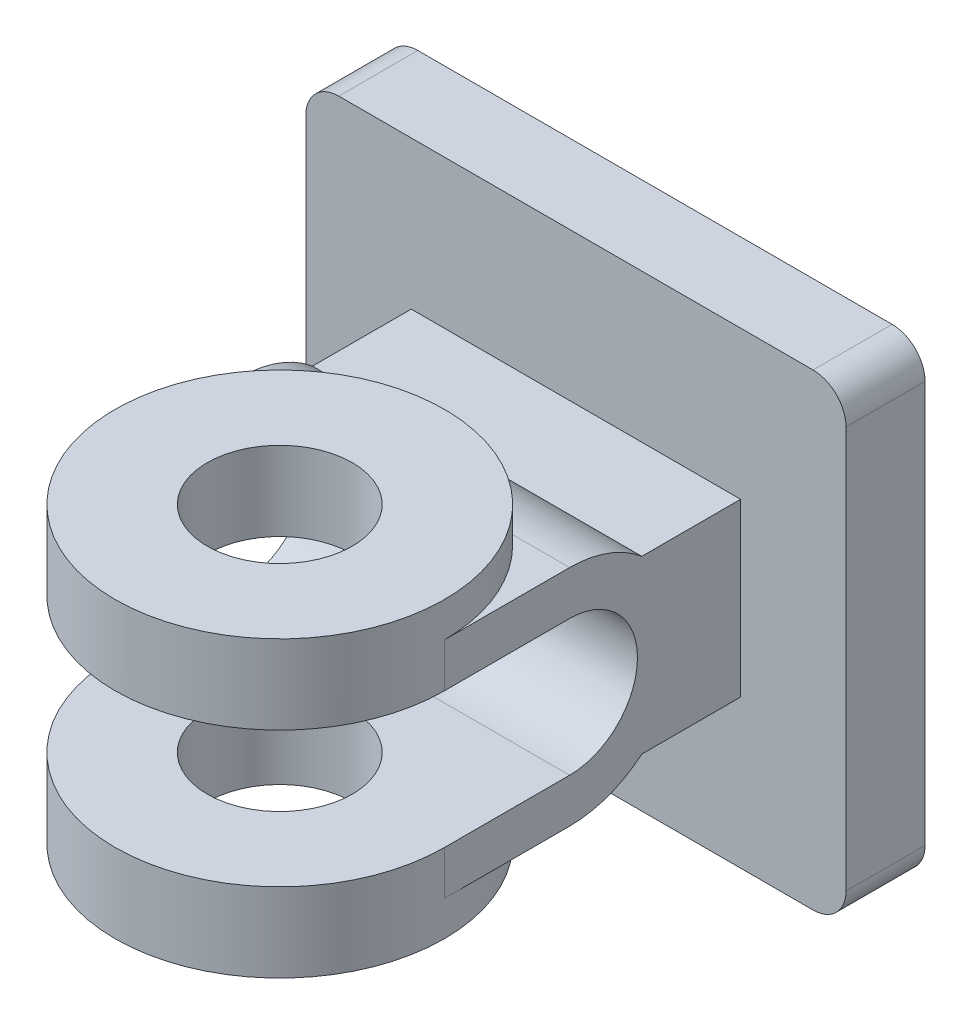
ISO-10303-21;
HEADER;
FILE_DESCRIPTION(('STEP AP214'),'2;1');
FILE_NAME('part.step','',(''),(''),'','','');
FILE_SCHEMA(('AUTOMOTIVE_DESIGN { 1 0 10303 214 1 1 1 1 }'));
ENDSEC;
DATA;
#1=APPLICATION_CONTEXT('core data for automotive mechanical design processes');
#2=APPLICATION_PROTOCOL_DEFINITION('international standard','automotive_design',2000,#1);
#3=PRODUCT_CONTEXT('',#1,'mechanical');
#4=PRODUCT('Part','Part','',(#3));
#5=PRODUCT_RELATED_PRODUCT_CATEGORY('part','',(#4));
#6=PRODUCT_DEFINITION_FORMATION('','',#4);
#7=PRODUCT_DEFINITION_CONTEXT('part definition',#1,'design');
#8=PRODUCT_DEFINITION('design','',#6,#7);
#9=PRODUCT_DEFINITION_SHAPE('','',#8);
#10=(LENGTH_UNIT() NAMED_UNIT(*) SI_UNIT(.MILLI.,.METRE.));
#11=(NAMED_UNIT(*) PLANE_ANGLE_UNIT() SI_UNIT($,.RADIAN.));
#12=(NAMED_UNIT(*) SI_UNIT($,.STERADIAN.) SOLID_ANGLE_UNIT());
#13=UNCERTAINTY_MEASURE_WITH_UNIT(LENGTH_MEASURE(1.E-05),#10,'distance_accuracy_value','');
#14=(GEOMETRIC_REPRESENTATION_CONTEXT(3) GLOBAL_UNCERTAINTY_ASSIGNED_CONTEXT((#13)) GLOBAL_UNIT_ASSIGNED_CONTEXT((#10,
#11,#12)) REPRESENTATION_CONTEXT('',''));
#15=CARTESIAN_POINT('',(0.,0.,0.));
#16=DIRECTION('',(0.,0.,1.));
#17=DIRECTION('',(1.,0.,0.));
#18=AXIS2_PLACEMENT_3D('',#15,#16,#17);
#19=CARTESIAN_POINT('',(10.9375097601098,1.54766260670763E-06,-7.90292921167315));
#20=DIRECTION('',(-1.,0.,0.));
#21=DIRECTION('',(0.,0.,1.));
#22=AXIS2_PLACEMENT_3D('',#19,#20,#21);
#23=CYLINDRICAL_SURFACE('',#22,7.4375);
#24=CARTESIAN_POINT('',(7.10854336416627,7.43750154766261,-7.90292921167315));
#25=CARTESIAN_POINT('',(6.98800695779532,7.43749866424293,-8.00600938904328));
#26=CARTESIAN_POINT('',(6.86525507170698,7.43535896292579,-8.10644028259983));
#27=CARTESIAN_POINT('',(6.61560071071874,7.42744202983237,-8.30179979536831));
#28=CARTESIAN_POINT('',(6.48869912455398,7.42166557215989,-8.39672958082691));
#29=CARTESIAN_POINT('',(6.10239404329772,7.39984918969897,-8.67282425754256));
#30=CARTESIAN_POINT('',(5.83712512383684,7.37931945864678,-8.8455210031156));
#31=CARTESIAN_POINT('',(5.29299524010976,7.33107736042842,-9.16713182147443));
#32=CARTESIAN_POINT('',(5.01412401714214,7.30335950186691,-9.31602757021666));
#33=CARTESIAN_POINT('',(4.44472903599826,7.24519217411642,-9.5890822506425));
#34=CARTESIAN_POINT('',(4.15420328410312,7.2147422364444,-9.71323692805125));
#35=CARTESIAN_POINT('',(3.5828706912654,7.15712576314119,-9.92865872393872));
#36=CARTESIAN_POINT('',(3.30268469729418,7.12987508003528,-10.0215537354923));
#37=CARTESIAN_POINT('',(2.73540133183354,7.07942820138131,-10.1844652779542));
#38=CARTESIAN_POINT('',(2.44830486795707,7.0562314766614,-10.2544847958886));
#39=CARTESIAN_POINT('',(1.86943662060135,7.01632021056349,-10.3710210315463));
#40=CARTESIAN_POINT('',(1.57767369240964,6.99959462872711,-10.4175778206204));
#41=CARTESIAN_POINT('',(0.990974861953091,6.97428428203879,-10.4869490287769));
#42=CARTESIAN_POINT('',(0.696038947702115,6.9656995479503,-10.509763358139));
#43=CARTESIAN_POINT('',(0.101382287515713,6.95750594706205,-10.5315568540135));
#44=CARTESIAN_POINT('',(-0.198351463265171,6.95801310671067,-10.5302279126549));
#45=CARTESIAN_POINT('',(-0.7965442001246,6.96823503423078,-10.5029935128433));
#46=CARTESIAN_POINT('',(-1.09500314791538,6.97795007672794,-10.4770873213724));
#47=CARTESIAN_POINT('',(-1.68892236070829,7.00558487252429,-10.4008970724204));
#48=CARTESIAN_POINT('',(-1.98437651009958,7.02351886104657,-10.350570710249));
#49=CARTESIAN_POINT('',(-2.56971136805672,7.06570357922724,-10.2259819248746));
#50=CARTESIAN_POINT('',(-2.85959218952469,7.08995418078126,-10.1517199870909));
#51=CARTESIAN_POINT('',(-3.4264696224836,7.14169314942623,-9.98148529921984));
#52=CARTESIAN_POINT('',(-3.70360681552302,7.169110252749,-9.88595770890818));
#53=CARTESIAN_POINT('',(-4.24930831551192,7.22464003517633,-9.67298834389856));
#54=CARTESIAN_POINT('',(-4.51787129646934,7.25275282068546,-9.55554319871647));
#55=CARTESIAN_POINT('',(-5.04427021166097,7.30633638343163,-9.29968184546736));
#56=CARTESIAN_POINT('',(-5.3021307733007,7.33181345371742,-9.16131762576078));
#57=CARTESIAN_POINT('',(-5.80622000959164,7.37665347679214,-8.86416162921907));
#58=CARTESIAN_POINT('',(-6.05245565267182,7.39602013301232,-8.7053823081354));
#59=CARTESIAN_POINT('',(-6.43298358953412,7.4189135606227,-8.43775587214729));
#60=CARTESIAN_POINT('',(-6.5716014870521,7.42567899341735,-8.33528677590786));
#61=CARTESIAN_POINT('',(-6.84385970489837,7.43496984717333,-8.12389628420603));
#62=CARTESIAN_POINT('',(-6.97750245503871,7.43749736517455,-8.0149781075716));
#63=CARTESIAN_POINT('',(-7.10852384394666,7.43750154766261,-7.90292921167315));
#64=B_SPLINE_CURVE_WITH_KNOTS('',3,(#24,#25,#26,#27,#28,#29,#30,#31,#32,#33,#34,#35,#36,#37,#38,
#39,#40,#41,#42,#43,#44,#45,#46,#47,#48,#49,#50,#51,#52,#53,#54,#55,#56,#57,#58,#59,#60,#61,#62,
#63),.UNSPECIFIED.,.F.,.F.,(4,2,2,2,2,2,2,2,2,2,2,2,2,2,2,2,2,2,2,4),(0.,0.475687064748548,
0.951272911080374,1.9014028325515,2.85226075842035,3.8032820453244,4.69164351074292,
5.57988892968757,6.46661215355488,7.35333872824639,8.25138925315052,9.1494665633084,
10.0491052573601,10.9487257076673,11.8310391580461,12.7134884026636,13.5937795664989,
14.4735361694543,14.9908520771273,15.5079119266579),.UNSPECIFIED.);
#65=CARTESIAN_POINT('',(7.10854336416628,7.43750154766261,-7.90292921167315));
#66=VERTEX_POINT('',#65);
#67=CARTESIAN_POINT('',(-7.10852384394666,7.43750154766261,-7.90292921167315));
#68=VERTEX_POINT('',#67);
#69=EDGE_CURVE('E311',#66,#68,#64,.T.);
#70=ORIENTED_EDGE('',*,*,#69,.F.);
#71=DIRECTION('',(-1.,0.,0.));
#72=VECTOR('',#71,1.);
#73=CARTESIAN_POINT('',(10.9375097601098,7.43750154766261,-7.90292921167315));
#74=LINE('',#73,#72);
#75=CARTESIAN_POINT('',(10.9375097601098,7.43750154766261,-7.90292921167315));
#76=VERTEX_POINT('',#75);
#77=EDGE_CURVE('E406',#76,#66,#74,.T.);
#78=ORIENTED_EDGE('',*,*,#77,.F.);
#79=CARTESIAN_POINT('',(10.9375097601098,1.54766260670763E-06,-7.90292921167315));
#80=DIRECTION('',(1.,0.,0.));
#81=DIRECTION('',(0.,0.,-1.));
#82=AXIS2_PLACEMENT_3D('',#79,#80,#81);
#83=CIRCLE('',#82,7.4375);
#84=CARTESIAN_POINT('',(10.9375097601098,5.6875015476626,-12.6955015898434));
#85=VERTEX_POINT('',#84);
#86=EDGE_CURVE('E471',#85,#76,#83,.T.);
#87=ORIENTED_EDGE('',*,*,#86,.F.);
#88=DIRECTION('',(-1.,0.,0.));
#89=VECTOR('',#88,1.);
#90=CARTESIAN_POINT('',(10.9375097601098,5.6875015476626,-12.6955015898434));
#91=LINE('',#90,#89);
#92=CARTESIAN_POINT('',(-10.9374902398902,5.6875015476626,-12.6955015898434));
#93=VERTEX_POINT('',#92);
#94=EDGE_CURVE('E227',#85,#93,#91,.T.);
#95=ORIENTED_EDGE('',*,*,#94,.T.);
#96=CARTESIAN_POINT('',(-10.9374902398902,1.54766260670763E-06,-7.90292921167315));
#97=DIRECTION('',(1.,0.,0.));
#98=DIRECTION('',(0.,0.,-1.));
#99=AXIS2_PLACEMENT_3D('',#96,#97,#98);
#100=CIRCLE('',#99,7.4375);
#101=CARTESIAN_POINT('',(-10.9374902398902,7.43750154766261,-7.90292921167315));
#102=VERTEX_POINT('',#101);
#103=EDGE_CURVE('E457',#93,#102,#100,.T.);
#104=ORIENTED_EDGE('',*,*,#103,.T.);
#105=EDGE_CURVE('E409',#68,#102,#74,.T.);
#106=ORIENTED_EDGE('',*,*,#105,.F.);
#107=EDGE_LOOP('',(#70,#78,#87,#95,#104,#106));
#108=FACE_BOUND('',#107,.T.);
#109=ADVANCED_FACE('F46',(#108),#23,.T.);
#110=CARTESIAN_POINT('',(10.9375097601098,7.43750154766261,-7.90292921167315));
#111=DIRECTION('',(0.,-1.,0.));
#112=DIRECTION('',(0.,0.,-1.));
#113=AXIS2_PLACEMENT_3D('',#110,#111,#112);
#114=PLANE('',#113);
#115=CARTESIAN_POINT('',(9.760109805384E-06,7.4375015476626,0.40957078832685));
#116=DIRECTION('',(0.,-1.,0.));
#117=DIRECTION('',(0.,0.,-1.));
#118=AXIS2_PLACEMENT_3D('',#115,#116,#117);
#119=CIRCLE('',#118,10.9375);
#120=CARTESIAN_POINT('',(-10.9374902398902,7.4375015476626,0.409570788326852));
#121=VERTEX_POINT('',#120);
#122=EDGE_CURVE('E306',#68,#121,#119,.F.);
#123=ORIENTED_EDGE('',*,*,#122,.F.);
#124=ORIENTED_EDGE('',*,*,#105,.T.);
#125=DIRECTION('',(0.,0.,1.));
#126=VECTOR('',#125,1.);
#127=CARTESIAN_POINT('',(-10.9374902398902,7.43750154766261,-7.90292921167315));
#128=LINE('',#127,#126);
#129=EDGE_CURVE('E459',#102,#121,#128,.T.);
#130=ORIENTED_EDGE('',*,*,#129,.T.);
#131=EDGE_LOOP('',(#123,#124,#130));
#132=FACE_BOUND('',#131,.T.);
#133=ADVANCED_FACE('F395',(#132),#114,.F.);
#134=CARTESIAN_POINT('',(10.9375097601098,-7.43749845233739,-7.90292921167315));
#135=DIRECTION('',(0.,1.,0.));
#136=DIRECTION('',(0.,0.,1.));
#137=AXIS2_PLACEMENT_3D('',#134,#135,#136);
#138=PLANE('',#137);
#139=DIRECTION('',(0.,0.,-1.));
#140=VECTOR('',#139,1.);
#141=CARTESIAN_POINT('',(10.9375097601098,-7.43749845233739,-7.90292921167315));
#142=LINE('',#141,#140);
#143=CARTESIAN_POINT('',(10.9375097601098,-7.43749845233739,0.409570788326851));
#144=VERTEX_POINT('',#143);
#145=CARTESIAN_POINT('',(10.9375097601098,-7.43749845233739,-7.90292921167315));
#146=VERTEX_POINT('',#145);
#147=EDGE_CURVE('E493',#144,#146,#142,.T.);
#148=ORIENTED_EDGE('',*,*,#147,.F.);
#149=CARTESIAN_POINT('',(9.760109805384E-06,-7.43749845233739,0.40957078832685));
#150=DIRECTION('',(0.,1.,0.));
#151=DIRECTION('',(0.,0.,1.));
#152=AXIS2_PLACEMENT_3D('',#149,#150,#151);
#153=CIRCLE('',#152,10.9375);
#154=CARTESIAN_POINT('',(7.10854336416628,-7.43749845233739,-7.90292921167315));
#155=VERTEX_POINT('',#154);
#156=EDGE_CURVE('E357',#144,#155,#153,.T.);
#157=ORIENTED_EDGE('',*,*,#156,.T.);
#158=DIRECTION('',(-1.,0.,0.));
#159=VECTOR('',#158,1.);
#160=CARTESIAN_POINT('',(10.9375097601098,-7.43749845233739,-7.90292921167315));
#161=LINE('',#160,#159);
#162=EDGE_CURVE('E231',#146,#155,#161,.T.);
#163=ORIENTED_EDGE('',*,*,#162,.F.);
#164=EDGE_LOOP('',(#148,#157,#163));
#165=FACE_BOUND('',#164,.T.);
#166=ADVANCED_FACE('F373',(#165),#138,.F.);
#167=CARTESIAN_POINT('',(10.9375097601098,1.54766260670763E-06,-7.90292921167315));
#168=DIRECTION('',(-1.,0.,0.));
#169=DIRECTION('',(0.,0.,1.));
#170=AXIS2_PLACEMENT_3D('',#167,#168,#169);
#171=CYLINDRICAL_SURFACE('',#170,4.50625);
#172=CARTESIAN_POINT('',(-10.9374902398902,1.54766260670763E-06,-7.90292921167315));
#173=DIRECTION('',(-1.,0.,0.));
#174=DIRECTION('',(0.,0.,-1.));
#175=AXIS2_PLACEMENT_3D('',#172,#173,#174);
#176=CIRCLE('',#175,4.50625);
#177=CARTESIAN_POINT('',(-10.9374902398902,4.50625154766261,-7.90292921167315));
#178=VERTEX_POINT('',#177);
#179=CARTESIAN_POINT('',(-10.9374902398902,-4.50624845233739,-7.90292921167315));
#180=VERTEX_POINT('',#179);
#181=EDGE_CURVE('E430',#178,#180,#176,.T.);
#182=ORIENTED_EDGE('',*,*,#181,.T.);
#183=DIRECTION('',(-1.,0.,0.));
#184=VECTOR('',#183,1.);
#185=CARTESIAN_POINT('',(10.9375097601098,-4.50624845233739,-7.90292921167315));
#186=LINE('',#185,#184);
#187=CARTESIAN_POINT('',(10.9375097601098,-4.50624845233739,-7.90292921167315));
#188=VERTEX_POINT('',#187);
#189=EDGE_CURVE('E234',#188,#180,#186,.T.);
#190=ORIENTED_EDGE('',*,*,#189,.F.);
#191=CARTESIAN_POINT('',(10.9375097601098,1.54766260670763E-06,-7.90292921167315));
#192=DIRECTION('',(-1.,0.,0.));
#193=DIRECTION('',(0.,0.,-1.));
#194=AXIS2_PLACEMENT_3D('',#191,#192,#193);
#195=CIRCLE('',#194,4.50625);
#196=CARTESIAN_POINT('',(10.9375097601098,4.50625154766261,-7.90292921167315));
#197=VERTEX_POINT('',#196);
#198=EDGE_CURVE('E360',#197,#188,#195,.T.);
#199=ORIENTED_EDGE('',*,*,#198,.F.);
#200=DIRECTION('',(-1.,0.,0.));
#201=VECTOR('',#200,1.);
#202=CARTESIAN_POINT('',(10.9375097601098,4.50625154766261,-7.90292921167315));
#203=LINE('',#202,#201);
#204=EDGE_CURVE('E467',#197,#178,#203,.T.);
#205=ORIENTED_EDGE('',*,*,#204,.T.);
#206=EDGE_LOOP('',(#182,#190,#199,#205));
#207=FACE_BOUND('',#206,.T.);
#208=ADVANCED_FACE('F376',(#207),#171,.F.);
#209=CARTESIAN_POINT('',(10.9375097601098,-4.50624845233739,-7.90292921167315));
#210=DIRECTION('',(0.,-1.,0.));
#211=DIRECTION('',(0.,0.,-1.));
#212=AXIS2_PLACEMENT_3D('',#209,#210,#211);
#213=PLANE('',#212);
#214=CARTESIAN_POINT('',(9.760109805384E-06,-4.50624845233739,0.409570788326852));
#215=DIRECTION('',(0.,1.,0.));
#216=DIRECTION('',(0.,0.,1.));
#217=AXIS2_PLACEMENT_3D('',#214,#215,#216);
#218=CIRCLE('',#217,4.8125);
#219=CARTESIAN_POINT('',(9.760109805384E-06,-4.5062484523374,5.22207078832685));
#220=VERTEX_POINT('',#219);
#221=EDGE_CURVE('E241',#220,#220,#218,.T.);
#222=ORIENTED_EDGE('',*,*,#221,.F.);
#223=EDGE_LOOP('',(#222));
#224=FACE_BOUND('',#223,.T.);
#225=DIRECTION('',(0.,0.,1.));
#226=VECTOR('',#225,1.);
#227=CARTESIAN_POINT('',(-10.9374902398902,-4.50624845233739,-7.90292921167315));
#228=LINE('',#227,#226);
#229=CARTESIAN_POINT('',(-10.9374902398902,-4.50624845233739,0.409570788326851));
#230=VERTEX_POINT('',#229);
#231=EDGE_CURVE('E424',#180,#230,#228,.T.);
#232=ORIENTED_EDGE('',*,*,#231,.T.);
#233=CARTESIAN_POINT('',(9.760109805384E-06,-4.50624845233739,0.40957078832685));
#234=DIRECTION('',(0.,1.,0.));
#235=DIRECTION('',(0.,0.,1.));
#236=AXIS2_PLACEMENT_3D('',#233,#234,#235);
#237=CIRCLE('',#236,10.9375);
#238=CARTESIAN_POINT('',(10.9375097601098,-4.50624845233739,0.409570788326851));
#239=VERTEX_POINT('',#238);
#240=EDGE_CURVE('E240',#230,#239,#237,.T.);
#241=ORIENTED_EDGE('',*,*,#240,.T.);
#242=DIRECTION('',(0.,0.,1.));
#243=VECTOR('',#242,1.);
#244=CARTESIAN_POINT('',(10.9375097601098,-4.50624845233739,-7.90292921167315));
#245=LINE('',#244,#243);
#246=EDGE_CURVE('E495',#188,#239,#245,.T.);
#247=ORIENTED_EDGE('',*,*,#246,.F.);
#248=ORIENTED_EDGE('',*,*,#189,.T.);
#249=EDGE_LOOP('',(#232,#241,#247,#248));
#250=FACE_BOUND('',#249,.T.);
#251=ADVANCED_FACE('F371',(#224,#250),#213,.F.);
#252=CARTESIAN_POINT('',(-7.10852384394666,-7.43749845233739,-7.90292921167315));
#253=VERTEX_POINT('',#252);
#254=CARTESIAN_POINT('',(-10.9374902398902,-7.43749845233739,-7.90292921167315));
#255=VERTEX_POINT('',#254);
#256=EDGE_CURVE('E225',#253,#255,#161,.T.);
#257=ORIENTED_EDGE('',*,*,#256,.F.);
#258=CARTESIAN_POINT('',(-10.9374902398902,-7.43749845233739,0.40957078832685));
#259=VERTEX_POINT('',#258);
#260=EDGE_CURVE('E358',#253,#259,#153,.T.);
#261=ORIENTED_EDGE('',*,*,#260,.T.);
#262=DIRECTION('',(0.,0.,-1.));
#263=VECTOR('',#262,1.);
#264=CARTESIAN_POINT('',(-10.9374902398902,-7.43749845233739,-7.90292921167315));
#265=LINE('',#264,#263);
#266=EDGE_CURVE('E434',#259,#255,#265,.T.);
#267=ORIENTED_EDGE('',*,*,#266,.T.);
#268=EDGE_LOOP('',(#257,#261,#267));
#269=FACE_BOUND('',#268,.T.);
#270=ADVANCED_FACE('F367',(#269),#138,.F.);
#271=CARTESIAN_POINT('',(10.9375097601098,1.54766260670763E-06,-7.90292921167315));
#272=DIRECTION('',(-1.,0.,0.));
#273=DIRECTION('',(0.,0.,1.));
#274=AXIS2_PLACEMENT_3D('',#271,#272,#273);
#275=CYLINDRICAL_SURFACE('',#274,7.4375);
#276=ORIENTED_EDGE('',*,*,#162,.T.);
#277=CARTESIAN_POINT('',(7.10854336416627,-7.43749845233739,-7.90292921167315));
#278=CARTESIAN_POINT('',(6.98800695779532,-7.43749556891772,-8.00600938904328));
#279=CARTESIAN_POINT('',(6.86525507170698,-7.43535586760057,-8.10644028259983));
#280=CARTESIAN_POINT('',(6.61560071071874,-7.42743893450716,-8.30179979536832));
#281=CARTESIAN_POINT('',(6.48869912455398,-7.42166247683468,-8.39672958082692));
#282=CARTESIAN_POINT('',(6.10239404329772,-7.39984609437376,-8.67282425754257));
#283=CARTESIAN_POINT('',(5.83712512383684,-7.37931636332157,-8.84552100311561));
#284=CARTESIAN_POINT('',(5.29299524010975,-7.33107426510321,-9.16713182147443));
#285=CARTESIAN_POINT('',(5.01412401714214,-7.30335640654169,-9.31602757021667));
#286=CARTESIAN_POINT('',(4.44472903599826,-7.2451890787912,-9.5890822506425));
#287=CARTESIAN_POINT('',(4.15420328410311,-7.21473914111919,-9.71323692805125));
#288=CARTESIAN_POINT('',(3.5828706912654,-7.15712266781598,-9.92865872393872));
#289=CARTESIAN_POINT('',(3.30268469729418,-7.12987198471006,-10.0215537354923));
#290=CARTESIAN_POINT('',(2.73540133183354,-7.0794251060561,-10.1844652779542));
#291=CARTESIAN_POINT('',(2.44830486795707,-7.05622838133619,-10.2544847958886));
#292=CARTESIAN_POINT('',(1.86943662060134,-7.01631711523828,-10.3710210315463));
#293=CARTESIAN_POINT('',(1.57767369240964,-6.99959153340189,-10.4175778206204));
#294=CARTESIAN_POINT('',(0.990974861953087,-6.97428118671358,-10.4869490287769));
#295=CARTESIAN_POINT('',(0.696038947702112,-6.96569645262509,-10.509763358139));
#296=CARTESIAN_POINT('',(0.101382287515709,-6.95750285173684,-10.5315568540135));
#297=CARTESIAN_POINT('',(-0.198351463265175,-6.95801001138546,-10.5302279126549));
#298=CARTESIAN_POINT('',(-0.796544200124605,-6.96823193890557,-10.5029935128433));
#299=CARTESIAN_POINT('',(-1.09500314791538,-6.97794698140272,-10.4770873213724));
#300=CARTESIAN_POINT('',(-1.68892236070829,-7.00558177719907,-10.4008970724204));
#301=CARTESIAN_POINT('',(-1.98437651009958,-7.02351576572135,-10.350570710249));
#302=CARTESIAN_POINT('',(-2.56971136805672,-7.06570048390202,-10.2259819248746));
#303=CARTESIAN_POINT('',(-2.8595921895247,-7.08995108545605,-10.1517199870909));
#304=CARTESIAN_POINT('',(-3.4264696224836,-7.14169005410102,-9.98148529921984));
#305=CARTESIAN_POINT('',(-3.70360681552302,-7.16910715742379,-9.88595770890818));
#306=CARTESIAN_POINT('',(-4.24930831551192,-7.22463693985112,-9.67298834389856));
#307=CARTESIAN_POINT('',(-4.51787129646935,-7.25274972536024,-9.55554319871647));
#308=CARTESIAN_POINT('',(-5.04427021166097,-7.30633328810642,-9.29968184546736));
#309=CARTESIAN_POINT('',(-5.3021307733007,-7.3318103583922,-9.16131762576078));
#310=CARTESIAN_POINT('',(-5.80622000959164,-7.37665038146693,-8.86416162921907));
#311=CARTESIAN_POINT('',(-6.05245565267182,-7.39601703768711,-8.7053823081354));
#312=CARTESIAN_POINT('',(-6.43298358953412,-7.41891046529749,-8.43775587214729));
#313=CARTESIAN_POINT('',(-6.5716014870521,-7.42567589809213,-8.33528677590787));
#314=CARTESIAN_POINT('',(-6.84385970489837,-7.43496675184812,-8.12389628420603));
#315=CARTESIAN_POINT('',(-6.97750245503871,-7.43749426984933,-8.0149781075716));
#316=CARTESIAN_POINT('',(-7.10852384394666,-7.43749845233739,-7.90292921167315));
#317=B_SPLINE_CURVE_WITH_KNOTS('',3,(#277,#278,#279,#280,#281,#282,#283,#284,#285,#286,#287,
#288,#289,#290,#291,#292,#293,#294,#295,#296,#297,#298,#299,#300,#301,#302,#303,#304,#305,#306,
#307,#308,#309,#310,#311,#312,#313,#314,#315,#316),.UNSPECIFIED.,.F.,.F.,(4,2,2,2,2,2,2,2,2,2,2,
2,2,2,2,2,2,2,2,4),(0.,0.475687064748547,0.951272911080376,1.90140283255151,2.85226075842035,
3.8032820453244,4.69164351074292,5.57988892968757,6.46661215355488,7.35333872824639,
8.25138925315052,9.1494665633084,10.0491052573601,10.9487257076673,11.8310391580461,
12.7134884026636,13.5937795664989,14.4735361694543,14.9908520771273,15.5079119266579),.UNSPECIFIED.);
#318=EDGE_CURVE('E349',#155,#253,#317,.T.);
#319=ORIENTED_EDGE('',*,*,#318,.T.);
#320=ORIENTED_EDGE('',*,*,#256,.T.);
#321=CARTESIAN_POINT('',(-10.9374902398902,1.54766260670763E-06,-7.90292921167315));
#322=DIRECTION('',(1.,0.,0.));
#323=DIRECTION('',(0.,0.,-1.));
#324=AXIS2_PLACEMENT_3D('',#321,#322,#323);
#325=CIRCLE('',#324,7.4375);
#326=CARTESIAN_POINT('',(-10.9374902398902,-5.68749845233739,-12.6955015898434));
#327=VERTEX_POINT('',#326);
#328=EDGE_CURVE('E218',#255,#327,#325,.T.);
#329=ORIENTED_EDGE('',*,*,#328,.T.);
#330=DIRECTION('',(-1.,0.,0.));
#331=VECTOR('',#330,1.);
#332=CARTESIAN_POINT('',(10.9375097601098,-5.68749845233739,-12.6955015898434));
#333=LINE('',#332,#331);
#334=CARTESIAN_POINT('',(10.9375097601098,-5.68749845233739,-12.6955015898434));
#335=VERTEX_POINT('',#334);
#336=EDGE_CURVE('E217',#335,#327,#333,.T.);
#337=ORIENTED_EDGE('',*,*,#336,.F.);
#338=CARTESIAN_POINT('',(10.9375097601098,1.54766260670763E-06,-7.90292921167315));
#339=DIRECTION('',(1.,0.,0.));
#340=DIRECTION('',(0.,0.,-1.));
#341=AXIS2_PLACEMENT_3D('',#338,#339,#340);
#342=CIRCLE('',#341,7.4375);
#343=EDGE_CURVE('E491',#146,#335,#342,.T.);
#344=ORIENTED_EDGE('',*,*,#343,.F.);
#345=EDGE_LOOP('',(#276,#319,#320,#329,#337,#344));
#346=FACE_BOUND('',#345,.T.);
#347=ADVANCED_FACE('F362',(#346),#275,.T.);
#348=CARTESIAN_POINT('',(10.9375097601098,-5.68749845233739,-12.6955015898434));
#349=DIRECTION('',(0.,1.,0.));
#350=DIRECTION('',(0.,0.,1.));
#351=AXIS2_PLACEMENT_3D('',#348,#349,#350);
#352=PLANE('',#351);
#353=DIRECTION('',(0.,0.,-1.));
#354=VECTOR('',#353,1.);
#355=CARTESIAN_POINT('',(-10.9374902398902,-5.68749845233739,-12.6955015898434));
#356=LINE('',#355,#354);
#357=CARTESIAN_POINT('',(-10.9374902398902,-5.68749845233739,-19.2580015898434));
#358=VERTEX_POINT('',#357);
#359=EDGE_CURVE('E202',#327,#358,#356,.T.);
#360=ORIENTED_EDGE('',*,*,#359,.T.);
#361=DIRECTION('',(-1.,0.,0.));
#362=VECTOR('',#361,1.);
#363=CARTESIAN_POINT('',(10.9375097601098,-5.68749845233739,-19.2580015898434));
#364=LINE('',#363,#362);
#365=CARTESIAN_POINT('',(10.9375097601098,-5.68749845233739,-19.2580015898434));
#366=VERTEX_POINT('',#365);
#367=EDGE_CURVE('E214',#366,#358,#364,.T.);
#368=ORIENTED_EDGE('',*,*,#367,.F.);
#369=DIRECTION('',(0.,0.,-1.));
#370=VECTOR('',#369,1.);
#371=CARTESIAN_POINT('',(10.9375097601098,-5.68749845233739,-12.6955015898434));
#372=LINE('',#371,#370);
#373=EDGE_CURVE('E489',#335,#366,#372,.T.);
#374=ORIENTED_EDGE('',*,*,#373,.F.);
#375=ORIENTED_EDGE('',*,*,#336,.T.);
#376=EDGE_LOOP('',(#360,#368,#374,#375));
#377=FACE_BOUND('',#376,.T.);
#378=ADVANCED_FACE('F212',(#377),#352,.F.);
#379=CARTESIAN_POINT('',(10.9375097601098,5.6875015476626,-12.6955015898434));
#380=DIRECTION('',(0.,-1.,0.));
#381=DIRECTION('',(0.,0.,-1.));
#382=AXIS2_PLACEMENT_3D('',#379,#380,#381);
#383=PLANE('',#382);
#384=DIRECTION('',(0.,0.,1.));
#385=VECTOR('',#384,1.);
#386=CARTESIAN_POINT('',(-10.9374902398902,5.6875015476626,-12.6955015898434));
#387=LINE('',#386,#385);
#388=CARTESIAN_POINT('',(-10.9374902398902,5.68750154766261,-19.2580015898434));
#389=VERTEX_POINT('',#388);
#390=EDGE_CURVE('E204',#389,#93,#387,.T.);
#391=ORIENTED_EDGE('',*,*,#390,.T.);
#392=ORIENTED_EDGE('',*,*,#94,.F.);
#393=DIRECTION('',(0.,0.,1.));
#394=VECTOR('',#393,1.);
#395=CARTESIAN_POINT('',(10.9375097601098,5.6875015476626,-12.6955015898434));
#396=LINE('',#395,#394);
#397=CARTESIAN_POINT('',(10.9375097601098,5.68750154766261,-19.2580015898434));
#398=VERTEX_POINT('',#397);
#399=EDGE_CURVE('E486',#398,#85,#396,.T.);
#400=ORIENTED_EDGE('',*,*,#399,.F.);
#401=DIRECTION('',(-1.,0.,0.));
#402=VECTOR('',#401,1.);
#403=CARTESIAN_POINT('',(10.9375097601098,5.68750154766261,-19.2580015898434));
#404=LINE('',#403,#402);
#405=EDGE_CURVE('E223',#398,#389,#404,.T.);
#406=ORIENTED_EDGE('',*,*,#405,.T.);
#407=EDGE_LOOP('',(#391,#392,#400,#406));
#408=FACE_BOUND('',#407,.T.);
#409=ADVANCED_FACE('F506',(#408),#383,.F.);
#410=CARTESIAN_POINT('',(10.9375097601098,7.4375015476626,0.409570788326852));
#411=VERTEX_POINT('',#410);
#412=EDGE_CURVE('E312',#411,#66,#119,.F.);
#413=ORIENTED_EDGE('',*,*,#412,.F.);
#414=DIRECTION('',(0.,0.,1.));
#415=VECTOR('',#414,1.);
#416=CARTESIAN_POINT('',(10.9375097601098,7.43750154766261,-7.90292921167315));
#417=LINE('',#416,#415);
#418=EDGE_CURVE('E414',#76,#411,#417,.T.);
#419=ORIENTED_EDGE('',*,*,#418,.F.);
#420=ORIENTED_EDGE('',*,*,#77,.T.);
#421=EDGE_LOOP('',(#413,#419,#420));
#422=FACE_BOUND('',#421,.T.);
#423=ADVANCED_FACE('F401',(#422),#114,.F.);
#424=CARTESIAN_POINT('',(10.9375097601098,4.50625154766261,-7.90292921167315));
#425=DIRECTION('',(0.,1.,0.));
#426=DIRECTION('',(0.,0.,1.));
#427=AXIS2_PLACEMENT_3D('',#424,#425,#426);
#428=PLANE('',#427);
#429=CARTESIAN_POINT('',(9.760109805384E-06,4.50625154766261,0.409570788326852));
#430=DIRECTION('',(0.,1.,0.));
#431=DIRECTION('',(0.,0.,1.));
#432=AXIS2_PLACEMENT_3D('',#429,#430,#431);
#433=CIRCLE('',#432,4.8125);
#434=CARTESIAN_POINT('',(9.760109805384E-06,4.50625154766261,-4.40292921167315));
#435=VERTEX_POINT('',#434);
#436=EDGE_CURVE('E246',#435,#435,#433,.T.);
#437=ORIENTED_EDGE('',*,*,#436,.T.);
#438=EDGE_LOOP('',(#437));
#439=FACE_BOUND('',#438,.T.);
#440=DIRECTION('',(0.,0.,-1.));
#441=VECTOR('',#440,1.);
#442=CARTESIAN_POINT('',(10.9375097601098,4.50625154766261,-7.90292921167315));
#443=LINE('',#442,#441);
#444=CARTESIAN_POINT('',(10.9375097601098,4.50625154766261,0.409570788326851));
#445=VERTEX_POINT('',#444);
#446=EDGE_CURVE('E451',#445,#197,#443,.T.);
#447=ORIENTED_EDGE('',*,*,#446,.F.);
#448=CARTESIAN_POINT('',(9.760109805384E-06,4.50625154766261,0.40957078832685));
#449=DIRECTION('',(0.,1.,0.));
#450=DIRECTION('',(0.,0.,1.));
#451=AXIS2_PLACEMENT_3D('',#448,#449,#450);
#452=CIRCLE('',#451,10.9375);
#453=CARTESIAN_POINT('',(-10.9374902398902,4.50625154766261,0.40957078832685));
#454=VERTEX_POINT('',#453);
#455=EDGE_CURVE('E245',#454,#445,#452,.T.);
#456=ORIENTED_EDGE('',*,*,#455,.F.);
#457=DIRECTION('',(0.,0.,-1.));
#458=VECTOR('',#457,1.);
#459=CARTESIAN_POINT('',(-10.9374902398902,4.50625154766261,-7.90292921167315));
#460=LINE('',#459,#458);
#461=EDGE_CURVE('E464',#454,#178,#460,.T.);
#462=ORIENTED_EDGE('',*,*,#461,.T.);
#463=ORIENTED_EDGE('',*,*,#204,.F.);
#464=EDGE_LOOP('',(#447,#456,#462,#463));
#465=FACE_BOUND('',#464,.T.);
#466=ADVANCED_FACE('F478',(#439,#465),#428,.F.);
#467=CARTESIAN_POINT('',(10.9375097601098,1.54766260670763E-06,-7.90292921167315));
#468=DIRECTION('',(1.,0.,0.));
#469=DIRECTION('',(0.,0.,-1.));
#470=AXIS2_PLACEMENT_3D('',#467,#468,#469);
#471=PLANE('',#470);
#472=ORIENTED_EDGE('',*,*,#198,.T.);
#473=ORIENTED_EDGE('',*,*,#246,.T.);
#474=DIRECTION('',(0.,-1.,0.));
#475=VECTOR('',#474,1.);
#476=CARTESIAN_POINT('',(10.9375097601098,-4.50624845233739,0.409570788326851));
#477=LINE('',#476,#475);
#478=EDGE_CURVE('E441',#239,#144,#477,.T.);
#479=ORIENTED_EDGE('',*,*,#478,.T.);
#480=ORIENTED_EDGE('',*,*,#147,.T.);
#481=ORIENTED_EDGE('',*,*,#343,.T.);
#482=ORIENTED_EDGE('',*,*,#373,.T.);
#483=DIRECTION('',(0.,1.,0.));
#484=VECTOR('',#483,1.);
#485=CARTESIAN_POINT('',(10.9375097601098,5.68750154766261,-19.2580015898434));
#486=LINE('',#485,#484);
#487=EDGE_CURVE('E222',#366,#398,#486,.T.);
#488=ORIENTED_EDGE('',*,*,#487,.T.);
#489=ORIENTED_EDGE('',*,*,#399,.T.);
#490=ORIENTED_EDGE('',*,*,#86,.T.);
#491=ORIENTED_EDGE('',*,*,#418,.T.);
#492=DIRECTION('',(0.,-1.,0.));
#493=VECTOR('',#492,1.);
#494=CARTESIAN_POINT('',(10.9375097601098,4.50625154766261,0.409570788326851));
#495=LINE('',#494,#493);
#496=EDGE_CURVE('E417',#411,#445,#495,.T.);
#497=ORIENTED_EDGE('',*,*,#496,.T.);
#498=ORIENTED_EDGE('',*,*,#446,.T.);
#499=EDGE_LOOP('',(#472,#473,#479,#480,#481,#482,#488,#489,#490,#491,#497,#498));
#500=FACE_BOUND('',#499,.T.);
#501=ADVANCED_FACE('F346',(#500),#471,.T.);
#502=CARTESIAN_POINT('',(-10.9374902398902,1.54766260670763E-06,-7.90292921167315));
#503=DIRECTION('',(1.,0.,0.));
#504=DIRECTION('',(0.,0.,-1.));
#505=AXIS2_PLACEMENT_3D('',#502,#503,#504);
#506=PLANE('',#505);
#507=ORIENTED_EDGE('',*,*,#181,.F.);
#508=ORIENTED_EDGE('',*,*,#461,.F.);
#509=DIRECTION('',(0.,-1.,0.));
#510=VECTOR('',#509,1.);
#511=CARTESIAN_POINT('',(-10.9374902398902,4.50625154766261,0.409570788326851));
#512=LINE('',#511,#510);
#513=EDGE_CURVE('E461',#121,#454,#512,.T.);
#514=ORIENTED_EDGE('',*,*,#513,.F.);
#515=ORIENTED_EDGE('',*,*,#129,.F.);
#516=ORIENTED_EDGE('',*,*,#103,.F.);
#517=ORIENTED_EDGE('',*,*,#390,.F.);
#518=DIRECTION('',(0.,1.,0.));
#519=VECTOR('',#518,1.);
#520=CARTESIAN_POINT('',(-10.9374902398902,5.68750154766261,-19.2580015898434));
#521=LINE('',#520,#519);
#522=EDGE_CURVE('E197',#358,#389,#521,.T.);
#523=ORIENTED_EDGE('',*,*,#522,.F.);
#524=ORIENTED_EDGE('',*,*,#359,.F.);
#525=ORIENTED_EDGE('',*,*,#328,.F.);
#526=ORIENTED_EDGE('',*,*,#266,.F.);
#527=DIRECTION('',(0.,-1.,0.));
#528=VECTOR('',#527,1.);
#529=CARTESIAN_POINT('',(-10.9374902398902,-4.50624845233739,0.409570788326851));
#530=LINE('',#529,#528);
#531=EDGE_CURVE('E429',#230,#259,#530,.T.);
#532=ORIENTED_EDGE('',*,*,#531,.F.);
#533=ORIENTED_EDGE('',*,*,#231,.F.);
#534=EDGE_LOOP('',(#507,#508,#514,#515,#516,#517,#523,#524,#525,#526,#532,#533));
#535=FACE_BOUND('',#534,.T.);
#536=ADVANCED_FACE('F200',(#535),#506,.F.);
#537=CARTESIAN_POINT('',(9.760109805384E-06,-9.75624845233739,0.40957078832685));
#538=DIRECTION('',(0.,1.,0.));
#539=DIRECTION('',(0.,0.,1.));
#540=AXIS2_PLACEMENT_3D('',#537,#538,#539);
#541=CYLINDRICAL_SURFACE('',#540,10.9375);
#542=CARTESIAN_POINT('',(9.760109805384E-06,-9.75624845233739,0.40957078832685));
#543=DIRECTION('',(0.,1.,0.));
#544=DIRECTION('',(0.,0.,1.));
#545=AXIS2_PLACEMENT_3D('',#542,#543,#544);
#546=CIRCLE('',#545,10.9375);
#547=CARTESIAN_POINT('',(9.760109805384E-06,-9.75624845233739,11.3470707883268));
#548=VERTEX_POINT('',#547);
#549=EDGE_CURVE('E442',#548,#548,#546,.T.);
#550=ORIENTED_EDGE('',*,*,#549,.T.);
#551=EDGE_LOOP('',(#550));
#552=FACE_BOUND('',#551,.T.);
#553=ORIENTED_EDGE('',*,*,#478,.F.);
#554=ORIENTED_EDGE('',*,*,#240,.F.);
#555=ORIENTED_EDGE('',*,*,#531,.T.);
#556=ORIENTED_EDGE('',*,*,#260,.F.);
#557=ORIENTED_EDGE('',*,*,#318,.F.);
#558=ORIENTED_EDGE('',*,*,#156,.F.);
#559=EDGE_LOOP('',(#553,#554,#555,#556,#557,#558));
#560=FACE_BOUND('',#559,.T.);
#561=ADVANCED_FACE('F340',(#552,#560),#541,.T.);
#562=CARTESIAN_POINT('',(9.760109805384E-06,-9.75624845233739,0.40957078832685));
#563=DIRECTION('',(0.,1.,0.));
#564=DIRECTION('',(0.,0.,1.));
#565=AXIS2_PLACEMENT_3D('',#562,#563,#564);
#566=PLANE('',#565);
#567=CARTESIAN_POINT('',(9.760109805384E-06,-9.75624845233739,0.409570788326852));
#568=DIRECTION('',(0.,1.,0.));
#569=DIRECTION('',(0.,0.,1.));
#570=AXIS2_PLACEMENT_3D('',#567,#568,#569);
#571=CIRCLE('',#570,4.8125);
#572=CARTESIAN_POINT('',(9.760109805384E-06,-9.7562484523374,5.22207078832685));
#573=VERTEX_POINT('',#572);
#574=EDGE_CURVE('E237',#573,#573,#571,.T.);
#575=ORIENTED_EDGE('',*,*,#574,.T.);
#576=EDGE_LOOP('',(#575));
#577=FACE_BOUND('',#576,.T.);
#578=ORIENTED_EDGE('',*,*,#549,.F.);
#579=EDGE_LOOP('',(#578));
#580=FACE_BOUND('',#579,.T.);
#581=ADVANCED_FACE('F336',(#577,#580),#566,.F.);
#582=CARTESIAN_POINT('',(9.760109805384E-06,-15.8812484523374,0.409570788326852));
#583=DIRECTION('',(0.,1.,0.));
#584=DIRECTION('',(0.,0.,1.));
#585=AXIS2_PLACEMENT_3D('',#582,#583,#584);
#586=CYLINDRICAL_SURFACE('',#585,4.8125);
#587=CARTESIAN_POINT('',(9.760109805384E-06,-4.5062484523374,5.22207078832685));
#588=CARTESIAN_POINT('',(9.760109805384E-06,-4.5609359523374,5.22207078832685));
#589=CARTESIAN_POINT('',(9.760109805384E-06,-4.6156234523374,5.22207078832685));
#590=CARTESIAN_POINT('',(9.760109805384E-06,-4.7249984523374,5.22207078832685));
#591=CARTESIAN_POINT('',(9.760109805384E-06,-4.7796859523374,5.22207078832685));
#592=CARTESIAN_POINT('',(9.760109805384E-06,-4.8890609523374,5.22207078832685));
#593=CARTESIAN_POINT('',(9.760109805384E-06,-4.9437484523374,5.22207078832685));
#594=CARTESIAN_POINT('',(9.760109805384E-06,-5.0531234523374,5.22207078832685));
#595=CARTESIAN_POINT('',(9.760109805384E-06,-5.1078109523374,5.22207078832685));
#596=CARTESIAN_POINT('',(9.760109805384E-06,-5.2171859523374,5.22207078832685));
#597=CARTESIAN_POINT('',(9.760109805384E-06,-5.2718734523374,5.22207078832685));
#598=CARTESIAN_POINT('',(9.760109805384E-06,-5.3812484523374,5.22207078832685));
#599=CARTESIAN_POINT('',(9.760109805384E-06,-5.4359359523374,5.22207078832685));
#600=CARTESIAN_POINT('',(9.760109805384E-06,-5.5453109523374,5.22207078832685));
#601=CARTESIAN_POINT('',(9.760109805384E-06,-5.5999984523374,5.22207078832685));
#602=CARTESIAN_POINT('',(9.760109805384E-06,-5.7093734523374,5.22207078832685));
#603=CARTESIAN_POINT('',(9.760109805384E-06,-5.7640609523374,5.22207078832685));
#604=CARTESIAN_POINT('',(9.760109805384E-06,-5.8734359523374,5.22207078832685));
#605=CARTESIAN_POINT('',(9.760109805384E-06,-5.9281234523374,5.22207078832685));
#606=CARTESIAN_POINT('',(9.760109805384E-06,-6.0374984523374,5.22207078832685));
#607=CARTESIAN_POINT('',(9.760109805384E-06,-6.0921859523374,5.22207078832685));
#608=CARTESIAN_POINT('',(9.760109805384E-06,-6.2015609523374,5.22207078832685));
#609=CARTESIAN_POINT('',(9.760109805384E-06,-6.25624845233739,5.22207078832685));
#610=CARTESIAN_POINT('',(9.760109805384E-06,-6.3656234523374,5.22207078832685));
#611=CARTESIAN_POINT('',(9.760109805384E-06,-6.4203109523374,5.22207078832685));
#612=CARTESIAN_POINT('',(9.760109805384E-06,-6.5296859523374,5.22207078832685));
#613=CARTESIAN_POINT('',(9.760109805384E-06,-6.5843734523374,5.22207078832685));
#614=CARTESIAN_POINT('',(9.760109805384E-06,-6.6937484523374,5.22207078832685));
#615=CARTESIAN_POINT('',(9.760109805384E-06,-6.7484359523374,5.22207078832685));
#616=CARTESIAN_POINT('',(9.760109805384E-06,-6.8578109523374,5.22207078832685));
#617=CARTESIAN_POINT('',(9.760109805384E-06,-6.9124984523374,5.22207078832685));
#618=CARTESIAN_POINT('',(9.760109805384E-06,-7.0218734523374,5.22207078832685));
#619=CARTESIAN_POINT('',(9.760109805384E-06,-7.07656095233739,5.22207078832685));
#620=CARTESIAN_POINT('',(9.760109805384E-06,-7.18593595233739,5.22207078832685));
#621=CARTESIAN_POINT('',(9.760109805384E-06,-7.2406234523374,5.22207078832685));
#622=CARTESIAN_POINT('',(9.760109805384E-06,-7.3499984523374,5.22207078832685));
#623=CARTESIAN_POINT('',(9.760109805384E-06,-7.4046859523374,5.22207078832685));
#624=CARTESIAN_POINT('',(9.760109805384E-06,-7.5140609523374,5.22207078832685));
#625=CARTESIAN_POINT('',(9.760109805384E-06,-7.5687484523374,5.22207078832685));
#626=CARTESIAN_POINT('',(9.760109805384E-06,-7.6781234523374,5.22207078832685));
#627=CARTESIAN_POINT('',(9.760109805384E-06,-7.7328109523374,5.22207078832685));
#628=CARTESIAN_POINT('',(9.760109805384E-06,-7.84218595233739,5.22207078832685));
#629=CARTESIAN_POINT('',(9.760109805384E-06,-7.8968734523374,5.22207078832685));
#630=CARTESIAN_POINT('',(9.760109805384E-06,-8.0062484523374,5.22207078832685));
#631=CARTESIAN_POINT('',(9.760109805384E-06,-8.0609359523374,5.22207078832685));
#632=CARTESIAN_POINT('',(9.760109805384E-06,-8.1703109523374,5.22207078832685));
#633=CARTESIAN_POINT('',(9.760109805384E-06,-8.2249984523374,5.22207078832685));
#634=CARTESIAN_POINT('',(9.760109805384E-06,-8.33437345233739,5.22207078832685));
#635=CARTESIAN_POINT('',(9.760109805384E-06,-8.3890609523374,5.22207078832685));
#636=CARTESIAN_POINT('',(9.760109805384E-06,-8.49843595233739,5.22207078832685));
#637=CARTESIAN_POINT('',(9.760109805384E-06,-8.55312345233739,5.22207078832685));
#638=CARTESIAN_POINT('',(9.760109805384E-06,-8.66249845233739,5.22207078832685));
#639=CARTESIAN_POINT('',(9.760109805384E-06,-8.71718595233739,5.22207078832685));
#640=CARTESIAN_POINT('',(9.760109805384E-06,-8.8265609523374,5.22207078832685));
#641=CARTESIAN_POINT('',(9.760109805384E-06,-8.8812484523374,5.22207078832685));
#642=CARTESIAN_POINT('',(9.760109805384E-06,-8.9906234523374,5.22207078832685));
#643=CARTESIAN_POINT('',(9.760109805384E-06,-9.0453109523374,5.22207078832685));
#644=CARTESIAN_POINT('',(9.760109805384E-06,-9.15468595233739,5.22207078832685));
#645=CARTESIAN_POINT('',(9.760109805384E-06,-9.2093734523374,5.22207078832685));
#646=CARTESIAN_POINT('',(9.760109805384E-06,-9.31874845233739,5.22207078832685));
#647=CARTESIAN_POINT('',(9.760109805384E-06,-9.37343595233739,5.22207078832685));
#648=CARTESIAN_POINT('',(9.760109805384E-06,-9.48281095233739,5.22207078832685));
#649=CARTESIAN_POINT('',(9.760109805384E-06,-9.53749845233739,5.22207078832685));
#650=CARTESIAN_POINT('',(9.760109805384E-06,-9.6468734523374,5.22207078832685));
#651=CARTESIAN_POINT('',(9.760109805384E-06,-9.70156095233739,5.22207078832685));
#652=CARTESIAN_POINT('',(9.760109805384E-06,-9.7562484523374,5.22207078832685));
#653=B_SPLINE_CURVE_WITH_KNOTS('',3,(#587,#588,#589,#590,#591,#592,#593,#594,#595,#596,#597,
#598,#599,#600,#601,#602,#603,#604,#605,#606,#607,#608,#609,#610,#611,#612,#613,#614,#615,#616,
#617,#618,#619,#620,#621,#622,#623,#624,#625,#626,#627,#628,#629,#630,#631,#632,#633,#634,#635,
#636,#637,#638,#639,#640,#641,#642,#643,#644,#645,#646,#647,#648,#649,#650,#651,#652),
.UNSPECIFIED.,.F.,.F.,(4,2,2,2,2,2,2,2,2,2,2,2,2,2,2,2,2,2,2,2,2,2,2,2,2,2,2,2,2,2,2,2,4),(0.,
0.164062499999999,0.328125,0.4921875,0.656250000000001,0.8203125,0.984374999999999,1.1484375,
1.3125,1.4765625,1.640625,1.8046875,1.96875,2.1328125,2.296875,2.4609375,2.625,2.7890625,
2.953125,3.1171875,3.28125,3.4453125,3.609375,3.7734375,3.9375,4.1015625,4.265625,4.4296875,
4.59375,4.7578125,4.921875,5.0859375,5.25),.UNSPECIFIED.);
#654=EDGE_CURVE('BSEAM331',#220,#573,#653,.T.);
#655=ORIENTED_EDGE('',*,*,#221,.T.);
#656=ORIENTED_EDGE('',*,*,#574,.F.);
#657=ORIENTED_EDGE('',*,*,#654,.T.);
#658=ORIENTED_EDGE('',*,*,#654,.F.);
#659=EDGE_LOOP('',(#655,#657,#656,#658));
#660=FACE_BOUND('',#659,.T.);
#661=ADVANCED_FACE('F331',(#660),#586,.F.);
#662=CARTESIAN_POINT('',(9.760109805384E-06,9.75625154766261,0.40957078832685));
#663=DIRECTION('',(0.,-1.,0.));
#664=DIRECTION('',(0.,0.,-1.));
#665=AXIS2_PLACEMENT_3D('',#662,#663,#664);
#666=CYLINDRICAL_SURFACE('',#665,10.9375);
#667=CARTESIAN_POINT('',(9.760109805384E-06,9.75625154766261,0.40957078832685));
#668=DIRECTION('',(0.,1.,0.));
#669=DIRECTION('',(0.,0.,1.));
#670=AXIS2_PLACEMENT_3D('',#667,#668,#669);
#671=CIRCLE('',#670,10.9375);
#672=CARTESIAN_POINT('',(9.760109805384E-06,9.75625154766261,11.3470707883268));
#673=VERTEX_POINT('',#672);
#674=EDGE_CURVE('E303',#673,#673,#671,.T.);
#675=ORIENTED_EDGE('',*,*,#674,.F.);
#676=EDGE_LOOP('',(#675));
#677=FACE_BOUND('',#676,.T.);
#678=ORIENTED_EDGE('',*,*,#455,.T.);
#679=ORIENTED_EDGE('',*,*,#496,.F.);
#680=ORIENTED_EDGE('',*,*,#412,.T.);
#681=ORIENTED_EDGE('',*,*,#69,.T.);
#682=ORIENTED_EDGE('',*,*,#122,.T.);
#683=ORIENTED_EDGE('',*,*,#513,.T.);
#684=EDGE_LOOP('',(#678,#679,#680,#681,#682,#683));
#685=FACE_BOUND('',#684,.T.);
#686=ADVANCED_FACE('F325',(#677,#685),#666,.T.);
#687=CARTESIAN_POINT('',(9.760109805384E-06,9.75625154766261,0.40957078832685));
#688=DIRECTION('',(0.,-1.,0.));
#689=DIRECTION('',(0.,0.,1.));
#690=AXIS2_PLACEMENT_3D('',#687,#688,#689);
#691=PLANE('',#690);
#692=CARTESIAN_POINT('',(9.760109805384E-06,9.75625154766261,0.409570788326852));
#693=DIRECTION('',(0.,-1.,0.));
#694=DIRECTION('',(0.,0.,-1.));
#695=AXIS2_PLACEMENT_3D('',#692,#693,#694);
#696=CIRCLE('',#695,4.8125);
#697=CARTESIAN_POINT('',(9.760109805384E-06,9.75625154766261,-4.40292921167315));
#698=VERTEX_POINT('',#697);
#699=EDGE_CURVE('E242',#698,#698,#696,.F.);
#700=ORIENTED_EDGE('',*,*,#699,.F.);
#701=EDGE_LOOP('',(#700));
#702=FACE_BOUND('',#701,.T.);
#703=ORIENTED_EDGE('',*,*,#674,.T.);
#704=EDGE_LOOP('',(#703));
#705=FACE_BOUND('',#704,.T.);
#706=ADVANCED_FACE('F330',(#702,#705),#691,.F.);
#707=CARTESIAN_POINT('',(9.760109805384E-06,15.8812515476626,0.409570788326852));
#708=DIRECTION('',(0.,-1.,0.));
#709=DIRECTION('',(0.,0.,-1.));
#710=AXIS2_PLACEMENT_3D('',#707,#708,#709);
#711=CYLINDRICAL_SURFACE('',#710,4.8125);
#712=CARTESIAN_POINT('',(9.760109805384E-06,4.50625154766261,-4.40292921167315));
#713=CARTESIAN_POINT('',(9.760109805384E-06,4.56093904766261,-4.40292921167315));
#714=CARTESIAN_POINT('',(9.760109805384E-06,4.61562654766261,-4.40292921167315));
#715=CARTESIAN_POINT('',(9.760109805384E-06,4.72500154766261,-4.40292921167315));
#716=CARTESIAN_POINT('',(9.760109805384E-06,4.77968904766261,-4.40292921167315));
#717=CARTESIAN_POINT('',(9.760109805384E-06,4.88906404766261,-4.40292921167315));
#718=CARTESIAN_POINT('',(9.760109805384E-06,4.94375154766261,-4.40292921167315));
#719=CARTESIAN_POINT('',(9.760109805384E-06,5.05312654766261,-4.40292921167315));
#720=CARTESIAN_POINT('',(9.760109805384E-06,5.10781404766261,-4.40292921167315));
#721=CARTESIAN_POINT('',(9.760109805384E-06,5.21718904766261,-4.40292921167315));
#722=CARTESIAN_POINT('',(9.760109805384E-06,5.27187654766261,-4.40292921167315));
#723=CARTESIAN_POINT('',(9.760109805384E-06,5.38125154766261,-4.40292921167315));
#724=CARTESIAN_POINT('',(9.760109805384E-06,5.43593904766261,-4.40292921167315));
#725=CARTESIAN_POINT('',(9.760109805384E-06,5.54531404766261,-4.40292921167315));
#726=CARTESIAN_POINT('',(9.760109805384E-06,5.60000154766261,-4.40292921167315));
#727=CARTESIAN_POINT('',(9.760109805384E-06,5.70937654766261,-4.40292921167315));
#728=CARTESIAN_POINT('',(9.760109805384E-06,5.76406404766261,-4.40292921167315));
#729=CARTESIAN_POINT('',(9.760109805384E-06,5.87343904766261,-4.40292921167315));
#730=CARTESIAN_POINT('',(9.760109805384E-06,5.92812654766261,-4.40292921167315));
#731=CARTESIAN_POINT('',(9.760109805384E-06,6.03750154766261,-4.40292921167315));
#732=CARTESIAN_POINT('',(9.760109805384E-06,6.09218904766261,-4.40292921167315));
#733=CARTESIAN_POINT('',(9.760109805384E-06,6.20156404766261,-4.40292921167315));
#734=CARTESIAN_POINT('',(9.760109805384E-06,6.25625154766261,-4.40292921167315));
#735=CARTESIAN_POINT('',(9.760109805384E-06,6.36562654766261,-4.40292921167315));
#736=CARTESIAN_POINT('',(9.760109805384E-06,6.42031404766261,-4.40292921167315));
#737=CARTESIAN_POINT('',(9.760109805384E-06,6.52968904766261,-4.40292921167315));
#738=CARTESIAN_POINT('',(9.760109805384E-06,6.58437654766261,-4.40292921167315));
#739=CARTESIAN_POINT('',(9.760109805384E-06,6.69375154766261,-4.40292921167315));
#740=CARTESIAN_POINT('',(9.760109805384E-06,6.74843904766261,-4.40292921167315));
#741=CARTESIAN_POINT('',(9.760109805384E-06,6.85781404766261,-4.40292921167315));
#742=CARTESIAN_POINT('',(9.760109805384E-06,6.91250154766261,-4.40292921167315));
#743=CARTESIAN_POINT('',(9.760109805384E-06,7.02187654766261,-4.40292921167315));
#744=CARTESIAN_POINT('',(9.760109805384E-06,7.07656404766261,-4.40292921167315));
#745=CARTESIAN_POINT('',(9.760109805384E-06,7.18593904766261,-4.40292921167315));
#746=CARTESIAN_POINT('',(9.760109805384E-06,7.24062654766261,-4.40292921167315));
#747=CARTESIAN_POINT('',(9.760109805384E-06,7.35000154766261,-4.40292921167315));
#748=CARTESIAN_POINT('',(9.760109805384E-06,7.40468904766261,-4.40292921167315));
#749=CARTESIAN_POINT('',(9.760109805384E-06,7.51406404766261,-4.40292921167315));
#750=CARTESIAN_POINT('',(9.760109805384E-06,7.56875154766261,-4.40292921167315));
#751=CARTESIAN_POINT('',(9.760109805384E-06,7.67812654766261,-4.40292921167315));
#752=CARTESIAN_POINT('',(9.760109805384E-06,7.73281404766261,-4.40292921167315));
#753=CARTESIAN_POINT('',(9.760109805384E-06,7.84218904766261,-4.40292921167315));
#754=CARTESIAN_POINT('',(9.760109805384E-06,7.89687654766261,-4.40292921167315));
#755=CARTESIAN_POINT('',(9.760109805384E-06,8.00625154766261,-4.40292921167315));
#756=CARTESIAN_POINT('',(9.760109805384E-06,8.06093904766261,-4.40292921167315));
#757=CARTESIAN_POINT('',(9.760109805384E-06,8.17031404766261,-4.40292921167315));
#758=CARTESIAN_POINT('',(9.760109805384E-06,8.22500154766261,-4.40292921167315));
#759=CARTESIAN_POINT('',(9.760109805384E-06,8.33437654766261,-4.40292921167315));
#760=CARTESIAN_POINT('',(9.760109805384E-06,8.38906404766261,-4.40292921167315));
#761=CARTESIAN_POINT('',(9.760109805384E-06,8.4984390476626,-4.40292921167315));
#762=CARTESIAN_POINT('',(9.760109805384E-06,8.55312654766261,-4.40292921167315));
#763=CARTESIAN_POINT('',(9.760109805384E-06,8.66250154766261,-4.40292921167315));
#764=CARTESIAN_POINT('',(9.760109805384E-06,8.71718904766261,-4.40292921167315));
#765=CARTESIAN_POINT('',(9.760109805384E-06,8.82656404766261,-4.40292921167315));
#766=CARTESIAN_POINT('',(9.760109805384E-06,8.88125154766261,-4.40292921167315));
#767=CARTESIAN_POINT('',(9.760109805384E-06,8.99062654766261,-4.40292921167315));
#768=CARTESIAN_POINT('',(9.760109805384E-06,9.04531404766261,-4.40292921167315));
#769=CARTESIAN_POINT('',(9.760109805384E-06,9.15468904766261,-4.40292921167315));
#770=CARTESIAN_POINT('',(9.760109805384E-06,9.20937654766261,-4.40292921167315));
#771=CARTESIAN_POINT('',(9.760109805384E-06,9.3187515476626,-4.40292921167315));
#772=CARTESIAN_POINT('',(9.760109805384E-06,9.37343904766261,-4.40292921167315));
#773=CARTESIAN_POINT('',(9.760109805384E-06,9.48281404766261,-4.40292921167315));
#774=CARTESIAN_POINT('',(9.760109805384E-06,9.5375015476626,-4.40292921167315));
#775=CARTESIAN_POINT('',(9.760109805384E-06,9.64687654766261,-4.40292921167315));
#776=CARTESIAN_POINT('',(9.760109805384E-06,9.70156404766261,-4.40292921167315));
#777=CARTESIAN_POINT('',(9.760109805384E-06,9.75625154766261,-4.40292921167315));
#778=B_SPLINE_CURVE_WITH_KNOTS('',3,(#712,#713,#714,#715,#716,#717,#718,#719,#720,#721,#722,
#723,#724,#725,#726,#727,#728,#729,#730,#731,#732,#733,#734,#735,#736,#737,#738,#739,#740,#741,
#742,#743,#744,#745,#746,#747,#748,#749,#750,#751,#752,#753,#754,#755,#756,#757,#758,#759,#760,
#761,#762,#763,#764,#765,#766,#767,#768,#769,#770,#771,#772,#773,#774,#775,#776,#777),
.UNSPECIFIED.,.F.,.F.,(4,2,2,2,2,2,2,2,2,2,2,2,2,2,2,2,2,2,2,2,2,2,2,2,2,2,2,2,2,2,2,2,4),(0.,
0.164062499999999,0.328125,0.4921875,0.656250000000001,0.8203125,0.984374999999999,1.1484375,
1.3125,1.4765625,1.640625,1.8046875,1.96875,2.1328125,2.296875,2.4609375,2.625,2.7890625,
2.953125,3.1171875,3.28125,3.4453125,3.609375,3.7734375,3.9375,4.1015625,4.265625,4.4296875,
4.59375,4.7578125,4.921875,5.0859375,5.25),.UNSPECIFIED.);
#779=EDGE_CURVE('BSEAM509',#435,#698,#778,.T.);
#780=ORIENTED_EDGE('',*,*,#436,.F.);
#781=ORIENTED_EDGE('',*,*,#699,.T.);
#782=ORIENTED_EDGE('',*,*,#779,.T.);
#783=ORIENTED_EDGE('',*,*,#779,.F.);
#784=EDGE_LOOP('',(#780,#782,#781,#783));
#785=FACE_BOUND('',#784,.T.);
#786=ADVANCED_FACE('F509',(#785),#711,.F.);
#787=CARTESIAN_POINT('',(-17.9374902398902,-15.5312484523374,-24.5080015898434));
#788=DIRECTION('',(1.,0.,0.));
#789=DIRECTION('',(0.,0.,-1.));
#790=AXIS2_PLACEMENT_3D('',#787,#788,#789);
#791=PLANE('',#790);
#792=DIRECTION('',(0.,1.,0.));
#793=VECTOR('',#792,1.);
#794=CARTESIAN_POINT('',(-17.9374902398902,-15.5312484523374,-24.5080015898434));
#795=LINE('',#794,#793);
#796=CARTESIAN_POINT('',(-17.9374902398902,-13.3437484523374,-24.5080015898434));
#797=VERTEX_POINT('',#796);
#798=CARTESIAN_POINT('',(-17.9374902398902,13.3437515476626,-24.5080015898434));
#799=VERTEX_POINT('',#798);
#800=EDGE_CURVE('E299',#797,#799,#795,.T.);
#801=ORIENTED_EDGE('',*,*,#800,.F.);
#802=DIRECTION('',(0.,0.,1.));
#803=VECTOR('',#802,1.);
#804=CARTESIAN_POINT('',(-17.9374902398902,-13.3437484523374,-24.5080015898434));
#805=LINE('',#804,#803);
#806=CARTESIAN_POINT('',(-17.9374902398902,-13.3437484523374,-19.2580015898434));
#807=VERTEX_POINT('',#806);
#808=EDGE_CURVE('E248',#797,#807,#805,.T.);
#809=ORIENTED_EDGE('',*,*,#808,.T.);
#810=DIRECTION('',(0.,1.,0.));
#811=VECTOR('',#810,1.);
#812=CARTESIAN_POINT('',(-17.9374902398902,-15.5312484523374,-19.2580015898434));
#813=LINE('',#812,#811);
#814=CARTESIAN_POINT('',(-17.9374902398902,13.3437515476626,-19.2580015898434));
#815=VERTEX_POINT('',#814);
#816=EDGE_CURVE('E290',#807,#815,#813,.T.);
#817=ORIENTED_EDGE('',*,*,#816,.T.);
#818=DIRECTION('',(0.,0.,1.));
#819=VECTOR('',#818,1.);
#820=CARTESIAN_POINT('',(-17.9374902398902,13.3437515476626,-24.5080015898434));
#821=LINE('',#820,#819);
#822=EDGE_CURVE('E236',#815,#799,#821,.F.);
#823=ORIENTED_EDGE('',*,*,#822,.T.);
#824=EDGE_LOOP('',(#801,#809,#817,#823));
#825=FACE_BOUND('',#824,.T.);
#826=ADVANCED_FACE('F512',(#825),#791,.F.);
#827=CARTESIAN_POINT('',(17.9375097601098,15.5312515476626,-24.5080015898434));
#828=DIRECTION('',(0.,-1.,0.));
#829=DIRECTION('',(0.,0.,-1.));
#830=AXIS2_PLACEMENT_3D('',#827,#828,#829);
#831=PLANE('',#830);
#832=DIRECTION('',(1.,0.,0.));
#833=VECTOR('',#832,1.);
#834=CARTESIAN_POINT('',(17.9375097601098,15.5312515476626,-19.2580015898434));
#835=LINE('',#834,#833);
#836=CARTESIAN_POINT('',(-15.7499902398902,15.5312515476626,-19.2580015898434));
#837=VERTEX_POINT('',#836);
#838=CARTESIAN_POINT('',(15.7500097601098,15.5312515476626,-19.2580015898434));
#839=VERTEX_POINT('',#838);
#840=EDGE_CURVE('E281',#837,#839,#835,.T.);
#841=ORIENTED_EDGE('',*,*,#840,.T.);
#842=DIRECTION('',(0.,0.,1.));
#843=VECTOR('',#842,1.);
#844=CARTESIAN_POINT('',(15.7500097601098,15.5312515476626,-24.5080015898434));
#845=LINE('',#844,#843);
#846=CARTESIAN_POINT('',(15.7500097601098,15.5312515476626,-24.5080015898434));
#847=VERTEX_POINT('',#846);
#848=EDGE_CURVE('E12',#839,#847,#845,.F.);
#849=ORIENTED_EDGE('',*,*,#848,.T.);
#850=DIRECTION('',(1.,0.,0.));
#851=VECTOR('',#850,1.);
#852=CARTESIAN_POINT('',(17.9375097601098,15.5312515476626,-24.5080015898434));
#853=LINE('',#852,#851);
#854=CARTESIAN_POINT('',(-15.7499902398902,15.5312515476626,-24.5080015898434));
#855=VERTEX_POINT('',#854);
#856=EDGE_CURVE('E283',#855,#847,#853,.T.);
#857=ORIENTED_EDGE('',*,*,#856,.F.);
#858=DIRECTION('',(0.,0.,1.));
#859=VECTOR('',#858,1.);
#860=CARTESIAN_POINT('',(-15.7499902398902,15.5312515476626,-24.5080015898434));
#861=LINE('',#860,#859);
#862=EDGE_CURVE('E54',#855,#837,#861,.T.);
#863=ORIENTED_EDGE('',*,*,#862,.T.);
#864=EDGE_LOOP('',(#841,#849,#857,#863));
#865=FACE_BOUND('',#864,.T.);
#866=ADVANCED_FACE('F280',(#865),#831,.F.);
#867=CARTESIAN_POINT('',(17.9375097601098,-15.5312484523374,-24.5080015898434));
#868=DIRECTION('',(-1.,0.,0.));
#869=DIRECTION('',(0.,0.,1.));
#870=AXIS2_PLACEMENT_3D('',#867,#868,#869);
#871=PLANE('',#870);
#872=DIRECTION('',(0.,-1.,0.));
#873=VECTOR('',#872,1.);
#874=CARTESIAN_POINT('',(17.9375097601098,-15.5312484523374,-19.2580015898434));
#875=LINE('',#874,#873);
#876=CARTESIAN_POINT('',(17.9375097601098,13.3437515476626,-19.2580015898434));
#877=VERTEX_POINT('',#876);
#878=CARTESIAN_POINT('',(17.9375097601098,-13.3437484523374,-19.2580015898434));
#879=VERTEX_POINT('',#878);
#880=EDGE_CURVE('E289',#877,#879,#875,.T.);
#881=ORIENTED_EDGE('',*,*,#880,.T.);
#882=DIRECTION('',(0.,0.,1.));
#883=VECTOR('',#882,1.);
#884=CARTESIAN_POINT('',(17.9375097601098,-13.3437484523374,-24.5080015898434));
#885=LINE('',#884,#883);
#886=CARTESIAN_POINT('',(17.9375097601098,-13.3437484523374,-24.5080015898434));
#887=VERTEX_POINT('',#886);
#888=EDGE_CURVE('E61',#879,#887,#885,.F.);
#889=ORIENTED_EDGE('',*,*,#888,.T.);
#890=DIRECTION('',(0.,-1.,0.));
#891=VECTOR('',#890,1.);
#892=CARTESIAN_POINT('',(17.9375097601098,-15.5312484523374,-24.5080015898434));
#893=LINE('',#892,#891);
#894=CARTESIAN_POINT('',(17.9375097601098,13.3437515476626,-24.5080015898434));
#895=VERTEX_POINT('',#894);
#896=EDGE_CURVE('E719',#895,#887,#893,.T.);
#897=ORIENTED_EDGE('',*,*,#896,.F.);
#898=DIRECTION('',(0.,0.,1.));
#899=VECTOR('',#898,1.);
#900=CARTESIAN_POINT('',(17.9375097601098,13.3437515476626,-24.5080015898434));
#901=LINE('',#900,#899);
#902=EDGE_CURVE('E271',#895,#877,#901,.T.);
#903=ORIENTED_EDGE('',*,*,#902,.T.);
#904=EDGE_LOOP('',(#881,#889,#897,#903));
#905=FACE_BOUND('',#904,.T.);
#906=ADVANCED_FACE('F542',(#905),#871,.F.);
#907=CARTESIAN_POINT('',(17.9375097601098,-15.5312484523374,-24.5080015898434));
#908=DIRECTION('',(0.,1.,0.));
#909=DIRECTION('',(0.,0.,1.));
#910=AXIS2_PLACEMENT_3D('',#907,#908,#909);
#911=PLANE('',#910);
#912=DIRECTION('',(-1.,0.,0.));
#913=VECTOR('',#912,1.);
#914=CARTESIAN_POINT('',(17.9375097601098,-15.5312484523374,-19.2580015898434));
#915=LINE('',#914,#913);
#916=CARTESIAN_POINT('',(15.7500097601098,-15.5312484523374,-19.2580015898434));
#917=VERTEX_POINT('',#916);
#918=CARTESIAN_POINT('',(-15.7499902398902,-15.5312484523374,-19.2580015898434));
#919=VERTEX_POINT('',#918);
#920=EDGE_CURVE('E292',#917,#919,#915,.T.);
#921=ORIENTED_EDGE('',*,*,#920,.T.);
#922=DIRECTION('',(0.,0.,1.));
#923=VECTOR('',#922,1.);
#924=CARTESIAN_POINT('',(-15.7499902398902,-15.5312484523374,-24.5080015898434));
#925=LINE('',#924,#923);
#926=CARTESIAN_POINT('',(-15.7499902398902,-15.5312484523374,-24.5080015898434));
#927=VERTEX_POINT('',#926);
#928=EDGE_CURVE('E262',#919,#927,#925,.F.);
#929=ORIENTED_EDGE('',*,*,#928,.T.);
#930=DIRECTION('',(-1.,0.,0.));
#931=VECTOR('',#930,1.);
#932=CARTESIAN_POINT('',(17.9375097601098,-15.5312484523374,-24.5080015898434));
#933=LINE('',#932,#931);
#934=CARTESIAN_POINT('',(15.7500097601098,-15.5312484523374,-24.5080015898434));
#935=VERTEX_POINT('',#934);
#936=EDGE_CURVE('E302',#935,#927,#933,.T.);
#937=ORIENTED_EDGE('',*,*,#936,.F.);
#938=DIRECTION('',(0.,0.,1.));
#939=VECTOR('',#938,1.);
#940=CARTESIAN_POINT('',(15.7500097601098,-15.5312484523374,-24.5080015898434));
#941=LINE('',#940,#939);
#942=EDGE_CURVE('E259',#935,#917,#941,.T.);
#943=ORIENTED_EDGE('',*,*,#942,.T.);
#944=EDGE_LOOP('',(#921,#929,#937,#943));
#945=FACE_BOUND('',#944,.T.);
#946=ADVANCED_FACE('F550',(#945),#911,.F.);
#947=CARTESIAN_POINT('',(9.760109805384E-06,1.54766260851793E-06,-24.5080015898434));
#948=DIRECTION('',(0.,0.,1.));
#949=DIRECTION('',(0.,-1.,0.));
#950=AXIS2_PLACEMENT_3D('',#947,#948,#949);
#951=PLANE('',#950);
#952=ORIENTED_EDGE('',*,*,#936,.T.);
#953=CARTESIAN_POINT('',(-15.7499902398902,-13.3437484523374,-24.5080015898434));
#954=DIRECTION('',(0.,0.,1.));
#955=DIRECTION('',(0.,-1.,0.));
#956=AXIS2_PLACEMENT_3D('',#953,#954,#955);
#957=CIRCLE('',#956,2.1875);
#958=EDGE_CURVE('E269',#927,#797,#957,.F.);
#959=ORIENTED_EDGE('',*,*,#958,.T.);
#960=ORIENTED_EDGE('',*,*,#800,.T.);
#961=CARTESIAN_POINT('',(-15.7499902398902,13.3437515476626,-24.5080015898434));
#962=DIRECTION('',(0.,0.,1.));
#963=DIRECTION('',(0.,-1.,0.));
#964=AXIS2_PLACEMENT_3D('',#961,#962,#963);
#965=CIRCLE('',#964,2.1875);
#966=EDGE_CURVE('E264',#799,#855,#965,.F.);
#967=ORIENTED_EDGE('',*,*,#966,.T.);
#968=ORIENTED_EDGE('',*,*,#856,.T.);
#969=CARTESIAN_POINT('',(15.7500097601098,13.3437515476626,-24.5080015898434));
#970=DIRECTION('',(0.,0.,1.));
#971=DIRECTION('',(0.,-1.,0.));
#972=AXIS2_PLACEMENT_3D('',#969,#970,#971);
#973=CIRCLE('',#972,2.1875);
#974=EDGE_CURVE('E68',#847,#895,#973,.F.);
#975=ORIENTED_EDGE('',*,*,#974,.T.);
#976=ORIENTED_EDGE('',*,*,#896,.T.);
#977=CARTESIAN_POINT('',(15.7500097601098,-13.3437484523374,-24.5080015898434));
#978=DIRECTION('',(0.,0.,1.));
#979=DIRECTION('',(0.,-1.,0.));
#980=AXIS2_PLACEMENT_3D('',#977,#978,#979);
#981=CIRCLE('',#980,2.1875);
#982=EDGE_CURVE('E267',#887,#935,#981,.F.);
#983=ORIENTED_EDGE('',*,*,#982,.T.);
#984=EDGE_LOOP('',(#952,#959,#960,#967,#968,#975,#976,#983));
#985=FACE_BOUND('',#984,.T.);
#986=ADVANCED_FACE('F558',(#985),#951,.F.);
#987=CARTESIAN_POINT('',(9.760109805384E-06,1.54766260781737E-06,-19.2580015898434));
#988=DIRECTION('',(0.,0.,1.));
#989=DIRECTION('',(0.,-1.,0.));
#990=AXIS2_PLACEMENT_3D('',#987,#988,#989);
#991=PLANE('',#990);
#992=ORIENTED_EDGE('',*,*,#367,.T.);
#993=ORIENTED_EDGE('',*,*,#522,.T.);
#994=ORIENTED_EDGE('',*,*,#405,.F.);
#995=ORIENTED_EDGE('',*,*,#487,.F.);
#996=EDGE_LOOP('',(#992,#993,#994,#995));
#997=FACE_BOUND('',#996,.T.);
#998=ORIENTED_EDGE('',*,*,#816,.F.);
#999=CARTESIAN_POINT('',(-15.7499902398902,-13.3437484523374,-19.2580015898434));
#1000=DIRECTION('',(0.,0.,1.));
#1001=DIRECTION('',(0.,-1.,0.));
#1002=AXIS2_PLACEMENT_3D('',#999,#1000,#1001);
#1003=CIRCLE('',#1002,2.1875);
#1004=EDGE_CURVE('E257',#807,#919,#1003,.T.);
#1005=ORIENTED_EDGE('',*,*,#1004,.T.);
#1006=ORIENTED_EDGE('',*,*,#920,.F.);
#1007=CARTESIAN_POINT('',(15.7500097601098,-13.3437484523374,-19.2580015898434));
#1008=DIRECTION('',(0.,0.,1.));
#1009=DIRECTION('',(0.,-1.,0.));
#1010=AXIS2_PLACEMENT_3D('',#1007,#1008,#1009);
#1011=CIRCLE('',#1010,2.1875);
#1012=EDGE_CURVE('E255',#917,#879,#1011,.T.);
#1013=ORIENTED_EDGE('',*,*,#1012,.T.);
#1014=ORIENTED_EDGE('',*,*,#880,.F.);
#1015=CARTESIAN_POINT('',(15.7500097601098,13.3437515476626,-19.2580015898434));
#1016=DIRECTION('',(0.,0.,1.));
#1017=DIRECTION('',(0.,-1.,0.));
#1018=AXIS2_PLACEMENT_3D('',#1015,#1016,#1017);
#1019=CIRCLE('',#1018,2.1875);
#1020=EDGE_CURVE('E253',#877,#839,#1019,.T.);
#1021=ORIENTED_EDGE('',*,*,#1020,.T.);
#1022=ORIENTED_EDGE('',*,*,#840,.F.);
#1023=CARTESIAN_POINT('',(-15.7499902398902,13.3437515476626,-19.2580015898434));
#1024=DIRECTION('',(0.,0.,1.));
#1025=DIRECTION('',(0.,-1.,0.));
#1026=AXIS2_PLACEMENT_3D('',#1023,#1024,#1025);
#1027=CIRCLE('',#1026,2.1875);
#1028=EDGE_CURVE('E251',#837,#815,#1027,.T.);
#1029=ORIENTED_EDGE('',*,*,#1028,.T.);
#1030=EDGE_LOOP('',(#998,#1005,#1006,#1013,#1014,#1021,#1022,#1029));
#1031=FACE_BOUND('',#1030,.T.);
#1032=ADVANCED_FACE('F220',(#997,#1031),#991,.T.);
#1033=CARTESIAN_POINT('',(-15.7499902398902,-13.3437484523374,-24.5080015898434));
#1034=DIRECTION('',(0.,0.,1.));
#1035=DIRECTION('',(0.,-1.,0.));
#1036=AXIS2_PLACEMENT_3D('',#1033,#1034,#1035);
#1037=CYLINDRICAL_SURFACE('',#1036,2.1875);
#1038=ORIENTED_EDGE('',*,*,#958,.F.);
#1039=ORIENTED_EDGE('',*,*,#928,.F.);
#1040=ORIENTED_EDGE('',*,*,#1004,.F.);
#1041=ORIENTED_EDGE('',*,*,#808,.F.);
#1042=EDGE_LOOP('',(#1038,#1039,#1040,#1041));
#1043=FACE_BOUND('',#1042,.T.);
#1044=ADVANCED_FACE('F381',(#1043),#1037,.T.);
#1045=CARTESIAN_POINT('',(15.7500097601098,-13.3437484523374,-24.5080015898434));
#1046=DIRECTION('',(0.,0.,1.));
#1047=DIRECTION('',(0.,-1.,0.));
#1048=AXIS2_PLACEMENT_3D('',#1045,#1046,#1047);
#1049=CYLINDRICAL_SURFACE('',#1048,2.1875);
#1050=ORIENTED_EDGE('',*,*,#982,.F.);
#1051=ORIENTED_EDGE('',*,*,#888,.F.);
#1052=ORIENTED_EDGE('',*,*,#1012,.F.);
#1053=ORIENTED_EDGE('',*,*,#942,.F.);
#1054=EDGE_LOOP('',(#1050,#1051,#1052,#1053));
#1055=FACE_BOUND('',#1054,.T.);
#1056=ADVANCED_FACE('F384',(#1055),#1049,.T.);
#1057=CARTESIAN_POINT('',(15.7500097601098,13.3437515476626,-24.5080015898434));
#1058=DIRECTION('',(0.,0.,1.));
#1059=DIRECTION('',(0.,-1.,0.));
#1060=AXIS2_PLACEMENT_3D('',#1057,#1058,#1059);
#1061=CYLINDRICAL_SURFACE('',#1060,2.1875);
#1062=ORIENTED_EDGE('',*,*,#974,.F.);
#1063=ORIENTED_EDGE('',*,*,#848,.F.);
#1064=ORIENTED_EDGE('',*,*,#1020,.F.);
#1065=ORIENTED_EDGE('',*,*,#902,.F.);
#1066=EDGE_LOOP('',(#1062,#1063,#1064,#1065));
#1067=FACE_BOUND('',#1066,.T.);
#1068=ADVANCED_FACE('F387',(#1067),#1061,.T.);
#1069=CARTESIAN_POINT('',(-15.7499902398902,13.3437515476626,-24.5080015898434));
#1070=DIRECTION('',(0.,0.,1.));
#1071=DIRECTION('',(0.,-1.,0.));
#1072=AXIS2_PLACEMENT_3D('',#1069,#1070,#1071);
#1073=CYLINDRICAL_SURFACE('',#1072,2.1875);
#1074=ORIENTED_EDGE('',*,*,#966,.F.);
#1075=ORIENTED_EDGE('',*,*,#822,.F.);
#1076=ORIENTED_EDGE('',*,*,#1028,.F.);
#1077=ORIENTED_EDGE('',*,*,#862,.F.);
#1078=EDGE_LOOP('',(#1074,#1075,#1076,#1077));
#1079=FACE_BOUND('',#1078,.T.);
#1080=ADVANCED_FACE('F48',(#1079),#1073,.T.);
#1081=CLOSED_SHELL('',(#109,#133,#166,#208,#251,#270,#347,#378,#409,#423,#466,#501,#536,#561,
#581,#661,#686,#706,#786,#826,#866,#906,#946,#986,#1032,#1044,#1056,#1068,#1080));
#1082=MANIFOLD_SOLID_BREP('B2',#1081);
#1083=ADVANCED_BREP_SHAPE_REPRESENTATION('',(#18,#1082),#14);
#1084=SHAPE_DEFINITION_REPRESENTATION(#9,#1083);
ENDSEC;
END-ISO-10303-21;
